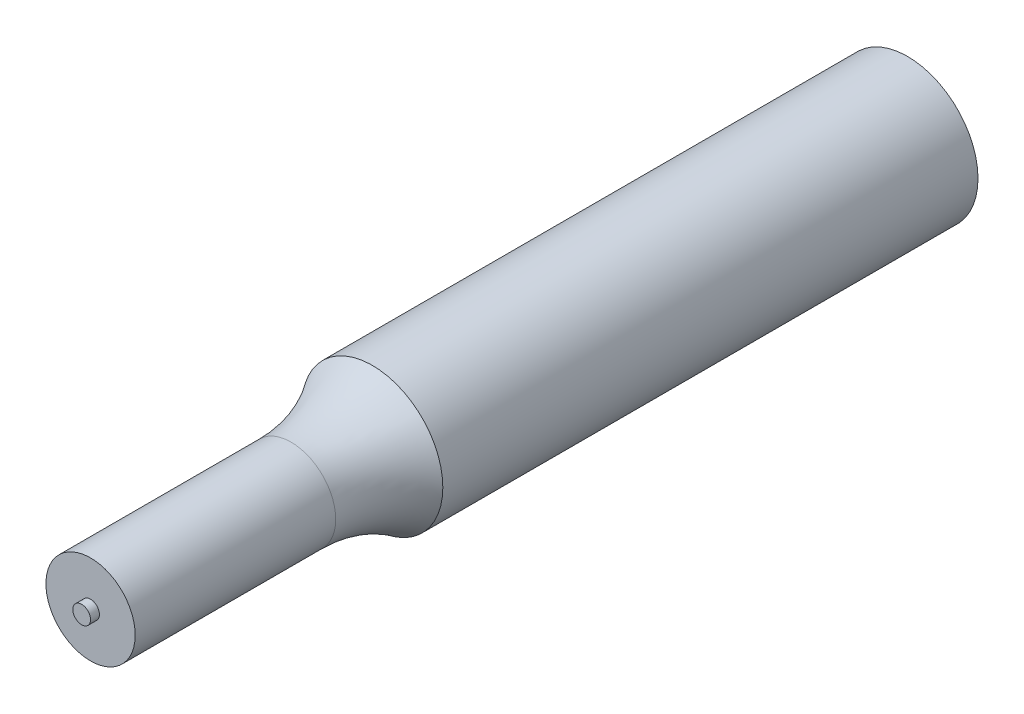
from build123d import *

# Parameters (mm, degrees)
LOGO3_BIB4_W = 0.8001
LOGO3_BIB4_H = 1.6002


with BuildPart() as part:
    # logo3_bib2 → Revolve2_Shoulder (revolve)
    with BuildSketch(Plane(origin=(0, 0, 0), x_dir=(1, 0, 0), z_dir=(0, 1, 0)), mode=Mode.PRIVATE) as revolve2_shoulder_sk:
        with BuildLine():
            Line((-6.35, -6.35), (0, -6.35))
            Line((0, -6.35), (0, -79.98333))
            Line((0, -79.98333), (-4.02336, -79.98333))
            Line((-4.02336, -79.98333), (-4.02336, -61.910225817))
            ThreePointArc((-4.02336, -61.910225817), (-4.618987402, -58.066508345), (-6.35, -54.58333))
            Line((-6.35, -54.58333), (-6.35, -6.35))
        make_face()
    revolve(revolve2_shoulder_sk.sketch.rotate(Axis((0, 0, 43.517168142), (0, 0, -1)), 180), axis=Axis((0, 0, 43.517168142), (0, 0, -1)))

    # logo3_bib4 → Revolve2_Shoulder_JT (revolve)
    with BuildSketch(Plane(origin=(0, 0, 0), x_dir=(1, 0, 0), z_dir=(0, 1, 0))):
        with Locations((-0.40005, -79.98333)):
            Rectangle(LOGO3_BIB4_W, LOGO3_BIB4_H)
    revolve(axis=Axis((0, 0, 0), (0, 0, 1)))

    # Sketch1_2 → Cut-Revolve_Ball_Shoulder (revolve, cut)
    with BuildSketch(Plane(origin=(0, 0, 0), x_dir=(1, 0, 0), z_dir=(0, 1, 0))):
        with BuildLine():
            Line((-15.531628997, -25.178899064), (-9.398, -2.287884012))
            Line((-9.398, -2.287884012), (-9.398, -33.1724))
            ThreePointArc((-9.398, -33.1724), (-14.435793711, -30.688035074), (-15.531628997, -25.178899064))
        make_face()
    revolve(axis=Axis((-9.398, 0, 12.118432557), (0, 0, 1)), mode=Mode.SUBTRACT)


solid = part.part
